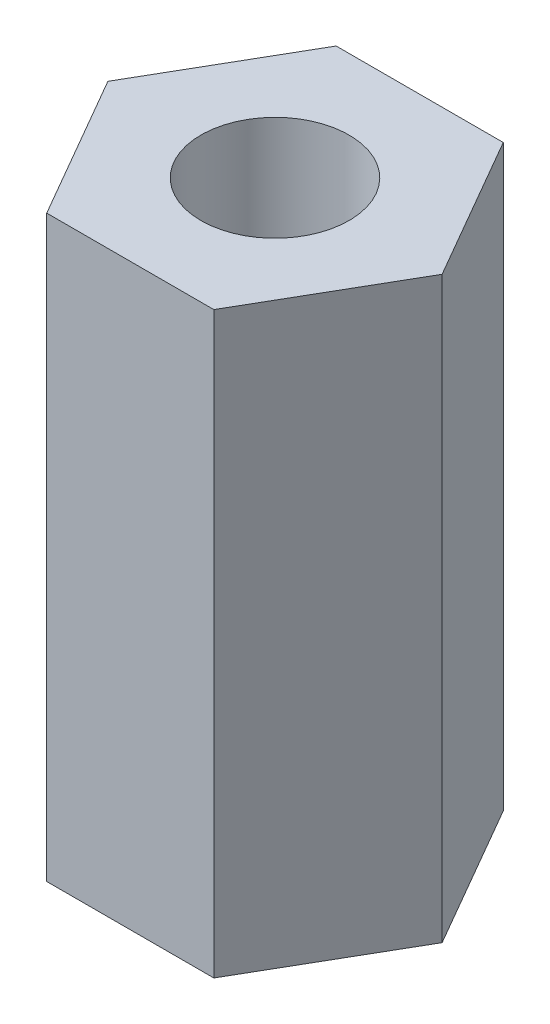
from build123d import *

# Parameters (mm, degrees)
SKETCH1_R           = 1.6256
BOSS_EXTRUDE1_DEPTH = 12.7


with BuildPart() as part:
    # Sketch1 → Boss-Extrude1 (new body)
    with BuildSketch(Plane(origin=(0, 0, 0), x_dir=(1, 0, 0), z_dir=(0, 1, 0))):
        Polygon((1.833087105, 3.175), (-1.833087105, 3.175), (-3.666174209, 0), (-1.833087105, -3.175), (1.833087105, -3.175), (3.666174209, 0), align=None)
        with Locations(Location((0, 0, 0), (0, 0, 270))):
            Circle(SKETCH1_R, mode=Mode.SUBTRACT)
    extrude(amount=BOSS_EXTRUDE1_DEPTH)


solid = part.part
